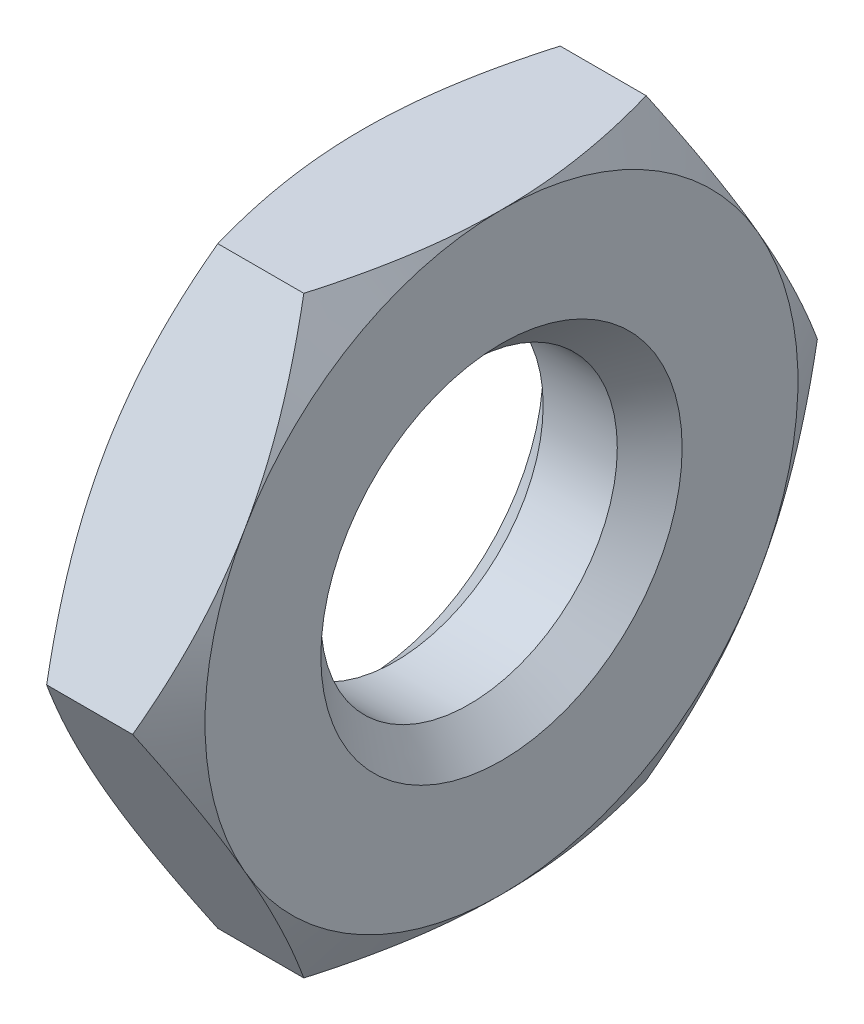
ISO-10303-21;
HEADER;
FILE_DESCRIPTION(('STEP AP214'),'2;1');
FILE_NAME('part.step','',(''),(''),'','','');
FILE_SCHEMA(('AUTOMOTIVE_DESIGN { 1 0 10303 214 1 1 1 1 }'));
ENDSEC;
DATA;
#1=APPLICATION_CONTEXT('core data for automotive mechanical design processes');
#2=APPLICATION_PROTOCOL_DEFINITION('international standard','automotive_design',2000,#1);
#3=PRODUCT_CONTEXT('',#1,'mechanical');
#4=PRODUCT('Part','Part','',(#3));
#5=PRODUCT_RELATED_PRODUCT_CATEGORY('part','',(#4));
#6=PRODUCT_DEFINITION_FORMATION('','',#4);
#7=PRODUCT_DEFINITION_CONTEXT('part definition',#1,'design');
#8=PRODUCT_DEFINITION('design','',#6,#7);
#9=PRODUCT_DEFINITION_SHAPE('','',#8);
#10=(LENGTH_UNIT() NAMED_UNIT(*) SI_UNIT(.MILLI.,.METRE.));
#11=(NAMED_UNIT(*) PLANE_ANGLE_UNIT() SI_UNIT($,.RADIAN.));
#12=(NAMED_UNIT(*) SI_UNIT($,.STERADIAN.) SOLID_ANGLE_UNIT());
#13=UNCERTAINTY_MEASURE_WITH_UNIT(LENGTH_MEASURE(1.E-05),#10,'distance_accuracy_value','');
#14=(GEOMETRIC_REPRESENTATION_CONTEXT(3) GLOBAL_UNCERTAINTY_ASSIGNED_CONTEXT((#13)) GLOBAL_UNIT_ASSIGNED_CONTEXT((#10,
#11,#12)) REPRESENTATION_CONTEXT('',''));
#15=CARTESIAN_POINT('',(0.,0.,0.));
#16=DIRECTION('',(0.,0.,1.));
#17=DIRECTION('',(1.,0.,0.));
#18=AXIS2_PLACEMENT_3D('',#15,#16,#17);
#19=CARTESIAN_POINT('',(0.75,1.6,-0.923760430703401));
#20=DIRECTION('',(1.,0.,0.));
#21=DIRECTION('',(0.,0.,-1.));
#22=AXIS2_PLACEMENT_3D('',#19,#20,#21);
#23=PLANE('',#22);
#24=CARTESIAN_POINT('',(0.75,0.,0.));
#25=DIRECTION('',(1.,0.,0.));
#26=DIRECTION('',(0.,0.,-1.));
#27=AXIS2_PLACEMENT_3D('',#24,#25,#26);
#28=CIRCLE('',#27,0.975000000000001);
#29=CARTESIAN_POINT('',(0.75,0.,-0.975000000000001));
#30=VERTEX_POINT('',#29);
#31=EDGE_CURVE('E11',#30,#30,#28,.F.);
#32=ORIENTED_EDGE('',*,*,#31,.T.);
#33=EDGE_LOOP('',(#32));
#34=FACE_BOUND('',#33,.T.);
#35=CARTESIAN_POINT('',(0.75,0.,0.));
#36=DIRECTION('',(1.,0.,0.));
#37=DIRECTION('',(0.,0.,-1.));
#38=AXIS2_PLACEMENT_3D('',#35,#36,#37);
#39=CIRCLE('',#38,1.6);
#40=CARTESIAN_POINT('',(0.75,-1.6,0.));
#41=VERTEX_POINT('',#40);
#42=CARTESIAN_POINT('',(0.75,-0.8,-1.3856406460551));
#43=VERTEX_POINT('',#42);
#44=EDGE_CURVE('E142',#41,#43,#39,.T.);
#45=ORIENTED_EDGE('',*,*,#44,.T.);
#46=CARTESIAN_POINT('',(0.75,0.8,-1.3856406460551));
#47=VERTEX_POINT('',#46);
#48=EDGE_CURVE('E130',#43,#47,#39,.T.);
#49=ORIENTED_EDGE('',*,*,#48,.T.);
#50=CARTESIAN_POINT('',(0.75,1.6,0.));
#51=VERTEX_POINT('',#50);
#52=EDGE_CURVE('E144',#47,#51,#39,.T.);
#53=ORIENTED_EDGE('',*,*,#52,.T.);
#54=CARTESIAN_POINT('',(0.75,0.8,1.3856406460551));
#55=VERTEX_POINT('',#54);
#56=EDGE_CURVE('E55',#51,#55,#39,.T.);
#57=ORIENTED_EDGE('',*,*,#56,.T.);
#58=CARTESIAN_POINT('',(0.75,-0.8,1.3856406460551));
#59=VERTEX_POINT('',#58);
#60=EDGE_CURVE('E63',#55,#59,#39,.T.);
#61=ORIENTED_EDGE('',*,*,#60,.T.);
#62=EDGE_CURVE('E166',#59,#41,#39,.T.);
#63=ORIENTED_EDGE('',*,*,#62,.T.);
#64=EDGE_LOOP('',(#45,#49,#53,#57,#61,#63));
#65=FACE_BOUND('',#64,.T.);
#66=ADVANCED_FACE('F39',(#34,#65),#23,.T.);
#67=CARTESIAN_POINT('',(0.,1.6,-0.923760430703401));
#68=DIRECTION('',(1.,0.,0.));
#69=DIRECTION('',(0.,0.,-1.));
#70=AXIS2_PLACEMENT_3D('',#67,#68,#69);
#71=PLANE('',#70);
#72=CARTESIAN_POINT('',(0.,0.,0.));
#73=DIRECTION('',(1.,0.,0.));
#74=DIRECTION('',(0.,0.,-1.));
#75=AXIS2_PLACEMENT_3D('',#72,#73,#74);
#76=CIRCLE('',#75,0.975);
#77=CARTESIAN_POINT('',(0.,0.,-0.975));
#78=VERTEX_POINT('',#77);
#79=EDGE_CURVE('E164',#78,#78,#76,.T.);
#80=ORIENTED_EDGE('',*,*,#79,.T.);
#81=EDGE_LOOP('',(#80));
#82=FACE_BOUND('',#81,.T.);
#83=CARTESIAN_POINT('',(0.,0.,0.));
#84=DIRECTION('',(1.,0.,0.));
#85=DIRECTION('',(0.,0.,-1.));
#86=AXIS2_PLACEMENT_3D('',#83,#84,#85);
#87=CIRCLE('',#86,1.6);
#88=CARTESIAN_POINT('',(0.,-0.8,-1.3856406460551));
#89=VERTEX_POINT('',#88);
#90=CARTESIAN_POINT('',(0.,0.8,-1.3856406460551));
#91=VERTEX_POINT('',#90);
#92=EDGE_CURVE('E173',#89,#91,#87,.T.);
#93=ORIENTED_EDGE('',*,*,#92,.F.);
#94=CARTESIAN_POINT('',(0.,-1.6,0.));
#95=VERTEX_POINT('',#94);
#96=EDGE_CURVE('E316',#95,#89,#87,.T.);
#97=ORIENTED_EDGE('',*,*,#96,.F.);
#98=CARTESIAN_POINT('',(0.,-0.8,1.3856406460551));
#99=VERTEX_POINT('',#98);
#100=EDGE_CURVE('E319',#99,#95,#87,.T.);
#101=ORIENTED_EDGE('',*,*,#100,.F.);
#102=CARTESIAN_POINT('',(0.,0.8,1.3856406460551));
#103=VERTEX_POINT('',#102);
#104=EDGE_CURVE('E325',#103,#99,#87,.T.);
#105=ORIENTED_EDGE('',*,*,#104,.F.);
#106=CARTESIAN_POINT('',(0.,1.6,0.));
#107=VERTEX_POINT('',#106);
#108=EDGE_CURVE('E178',#107,#103,#87,.T.);
#109=ORIENTED_EDGE('',*,*,#108,.F.);
#110=EDGE_CURVE('E174',#91,#107,#87,.T.);
#111=ORIENTED_EDGE('',*,*,#110,.F.);
#112=EDGE_LOOP('',(#93,#97,#101,#105,#109,#111));
#113=FACE_BOUND('',#112,.T.);
#114=ADVANCED_FACE('F317',(#82,#113),#71,.F.);
#115=CARTESIAN_POINT('',(0.75,0.,0.));
#116=DIRECTION('',(-1.,0.,0.));
#117=DIRECTION('',(0.,0.,1.));
#118=AXIS2_PLACEMENT_3D('',#115,#116,#117);
#119=CYLINDRICAL_SURFACE('',#118,0.8);
#120=CARTESIAN_POINT('',(0.175,0.,0.));
#121=DIRECTION('',(1.,0.,0.));
#122=DIRECTION('',(0.,0.,-1.));
#123=AXIS2_PLACEMENT_3D('',#120,#121,#122);
#124=CIRCLE('',#123,0.8);
#125=CARTESIAN_POINT('',(0.175,0.,-0.8));
#126=VERTEX_POINT('',#125);
#127=EDGE_CURVE('E48',#126,#126,#124,.F.);
#128=ORIENTED_EDGE('',*,*,#127,.T.);
#129=EDGE_LOOP('',(#128));
#130=FACE_BOUND('',#129,.T.);
#131=CARTESIAN_POINT('',(0.575,0.,0.));
#132=DIRECTION('',(1.,0.,0.));
#133=DIRECTION('',(0.,0.,-1.));
#134=AXIS2_PLACEMENT_3D('',#131,#132,#133);
#135=CIRCLE('',#134,0.8);
#136=CARTESIAN_POINT('',(0.575,0.,-0.8));
#137=VERTEX_POINT('',#136);
#138=EDGE_CURVE('E408',#137,#137,#135,.T.);
#139=ORIENTED_EDGE('',*,*,#138,.T.);
#140=EDGE_LOOP('',(#139));
#141=FACE_BOUND('',#140,.T.);
#142=ADVANCED_FACE('F234',(#130,#141),#119,.F.);
#143=CARTESIAN_POINT('',(0.,0.,0.));
#144=DIRECTION('',(1.,0.,0.));
#145=DIRECTION('',(0.,0.,-1.));
#146=AXIS2_PLACEMENT_3D('',#143,#144,#145);
#147=CONICAL_SURFACE('',#146,1.6,1.0471975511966);
#148=CARTESIAN_POINT('',(0.142972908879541,-1.6002,-0.923644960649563));
#149=CARTESIAN_POINT('',(0.119523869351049,-1.52988631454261,-0.964240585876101));
#150=CARTESIAN_POINT('',(0.0981973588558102,-1.45896568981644,-1.00518662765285));
#151=CARTESIAN_POINT('',(0.0609706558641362,-1.31589622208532,-1.08778782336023));
#152=CARTESIAN_POINT('',(0.0450836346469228,-1.24374483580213,-1.12944444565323));
#153=CARTESIAN_POINT('',(0.0203517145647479,-1.10033630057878,-1.21224140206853));
#154=CARTESIAN_POINT('',(0.0113422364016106,-1.02910122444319,-1.25336899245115));
#155=CARTESIAN_POINT('',(0.000584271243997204,-0.886295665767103,-1.33581782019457));
#156=CARTESIAN_POINT('',(-0.00117312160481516,-0.814725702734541,-1.37713875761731));
#157=CARTESIAN_POINT('',(0.0024711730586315,-0.680978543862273,-1.45435771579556));
#158=CARTESIAN_POINT('',(0.00697805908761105,-0.618781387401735,-1.49026726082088));
#159=CARTESIAN_POINT('',(0.0212658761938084,-0.494792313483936,-1.56185238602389));
#160=CARTESIAN_POINT('',(0.0310516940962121,-0.433000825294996,-1.59752771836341));
#161=CARTESIAN_POINT('',(0.0555169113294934,-0.308755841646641,-1.66926059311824));
#162=CARTESIAN_POINT('',(0.0703000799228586,-0.246318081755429,-1.70530905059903));
#163=CARTESIAN_POINT('',(0.103852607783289,-0.122374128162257,-1.77686812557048));
#164=CARTESIAN_POINT('',(0.122614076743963,-0.0608663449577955,-1.81237966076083));
#165=CARTESIAN_POINT('',(0.142972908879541,0.00020000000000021,-1.84763633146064));
#166=B_SPLINE_CURVE_WITH_KNOTS('',3,(#148,#149,#150,#151,#152,#153,#154,#155,#156,#157,#158,
#159,#160,#161,#162,#163,#164,#165),.UNSPECIFIED.,.F.,.F.,(4,2,2,2,2,2,2,2,4),(0.,
0.25362862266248,0.507867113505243,0.755812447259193,1.00345320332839,1.21912891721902,
1.43500463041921,1.65567058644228,1.87590291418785),.UNSPECIFIED.);
#167=CARTESIAN_POINT('',(0.142906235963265,0.,-1.8475208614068));
#168=VERTEX_POINT('',#167);
#169=EDGE_CURVE('E332',#89,#168,#166,.T.);
#170=ORIENTED_EDGE('',*,*,#169,.F.);
#171=ORIENTED_EDGE('',*,*,#92,.T.);
#172=CARTESIAN_POINT('',(0.142972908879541,-0.000199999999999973,-1.84763633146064));
#173=CARTESIAN_POINT('',(0.119523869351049,0.070113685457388,-1.8070407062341));
#174=CARTESIAN_POINT('',(0.0981973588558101,0.141034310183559,-1.76609466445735));
#175=CARTESIAN_POINT('',(0.0609706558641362,0.284103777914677,-1.68349346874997));
#176=CARTESIAN_POINT('',(0.0450836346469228,0.356255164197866,-1.64183684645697));
#177=CARTESIAN_POINT('',(0.0203517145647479,0.499663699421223,-1.55903989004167));
#178=CARTESIAN_POINT('',(0.0113422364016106,0.570898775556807,-1.51791229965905));
#179=CARTESIAN_POINT('',(0.000584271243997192,0.713704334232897,-1.43546347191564));
#180=CARTESIAN_POINT('',(-0.00117312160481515,0.785274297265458,-1.3941425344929));
#181=CARTESIAN_POINT('',(0.00247117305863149,0.919021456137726,-1.31692357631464));
#182=CARTESIAN_POINT('',(0.006978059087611,0.981218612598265,-1.28101403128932));
#183=CARTESIAN_POINT('',(0.0212658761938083,1.10520768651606,-1.20942890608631));
#184=CARTESIAN_POINT('',(0.031051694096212,1.166999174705,-1.1737535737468));
#185=CARTESIAN_POINT('',(0.0555169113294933,1.29124415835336,-1.10202069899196));
#186=CARTESIAN_POINT('',(0.0703000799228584,1.35368191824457,-1.06597224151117));
#187=CARTESIAN_POINT('',(0.103852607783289,1.47762587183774,-0.994413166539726));
#188=CARTESIAN_POINT('',(0.122614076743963,1.5391336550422,-0.958901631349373));
#189=CARTESIAN_POINT('',(0.142972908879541,1.6002,-0.923644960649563));
#190=B_SPLINE_CURVE_WITH_KNOTS('',3,(#172,#173,#174,#175,#176,#177,#178,#179,#180,#181,#182,
#183,#184,#185,#186,#187,#188,#189),.UNSPECIFIED.,.F.,.F.,(4,2,2,2,2,2,2,2,4),(0.,
0.25362862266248,0.507867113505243,0.755812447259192,1.00345320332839,1.21912891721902,
1.43500463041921,1.65567058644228,1.87590291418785),.UNSPECIFIED.);
#191=EDGE_CURVE('E215',#168,#91,#190,.T.);
#192=ORIENTED_EDGE('',*,*,#191,.F.);
#193=EDGE_LOOP('',(#170,#171,#192));
#194=FACE_BOUND('',#193,.T.);
#195=ADVANCED_FACE('F194',(#194),#147,.T.);
#196=ORIENTED_EDGE('',*,*,#96,.T.);
#197=CARTESIAN_POINT('',(0.142906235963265,-1.6,-0.923760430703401));
#198=VERTEX_POINT('',#197);
#199=EDGE_CURVE('E156',#198,#89,#166,.T.);
#200=ORIENTED_EDGE('',*,*,#199,.F.);
#201=CARTESIAN_POINT('',(0.781305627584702,-1.6,-2.48228741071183));
#202=CARTESIAN_POINT('',(0.747399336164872,-1.6,-2.41239835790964));
#203=CARTESIAN_POINT('',(0.713817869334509,-1.6,-2.342348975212));
#204=CARTESIAN_POINT('',(0.647487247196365,-1.6,-2.20184429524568));
#205=CARTESIAN_POINT('',(0.614738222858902,-1.6,-2.13138893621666));
#206=CARTESIAN_POINT('',(0.550090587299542,-1.6,-1.98962448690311));
#207=CARTESIAN_POINT('',(0.518197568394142,-1.6,-1.91831283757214));
#208=CARTESIAN_POINT('',(0.455715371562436,-1.6,-1.77512270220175));
#209=CARTESIAN_POINT('',(0.425126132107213,-1.6,-1.70324424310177));
#210=CARTESIAN_POINT('',(0.364636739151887,-1.6,-1.55647955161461));
#211=CARTESIAN_POINT('',(0.334790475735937,-1.6,-1.48157098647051));
#212=CARTESIAN_POINT('',(0.277354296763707,-1.6,-1.33087725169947));
#213=CARTESIAN_POINT('',(0.249764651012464,-1.6,-1.25509197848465));
#214=CARTESIAN_POINT('',(0.19756670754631,-1.6,-1.10266970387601));
#215=CARTESIAN_POINT('',(0.172952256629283,-1.6,-1.02603483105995));
#216=CARTESIAN_POINT('',(0.127490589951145,-1.6,-0.871659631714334));
#217=CARTESIAN_POINT('',(0.106642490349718,-1.6,-0.79391956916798));
#218=CARTESIAN_POINT('',(0.0698283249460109,-1.6,-0.637732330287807));
#219=CARTESIAN_POINT('',(0.0538354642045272,-1.6,-0.559291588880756));
#220=CARTESIAN_POINT('',(0.0276325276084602,-1.6,-0.401434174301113));
#221=CARTESIAN_POINT('',(0.0174219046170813,-1.6,-0.32201759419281));
#222=CARTESIAN_POINT('',(0.0037342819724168,-1.6,-0.163639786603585));
#223=CARTESIAN_POINT('',(0.000170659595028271,-1.6,-0.0846862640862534));
#224=CARTESIAN_POINT('',(-0.000158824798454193,-1.6,0.0732324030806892));
#225=CARTESIAN_POINT('',(0.003075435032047,-1.6,0.152197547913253));
#226=CARTESIAN_POINT('',(0.0187030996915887,-1.6,0.341588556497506));
#227=CARTESIAN_POINT('',(0.034285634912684,-1.6,0.451752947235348));
#228=CARTESIAN_POINT('',(0.0759566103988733,-1.6,0.670080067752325));
#229=CARTESIAN_POINT('',(0.10205531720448,-1.6,0.778240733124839));
#230=CARTESIAN_POINT('',(0.162565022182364,-1.6,0.994730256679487));
#231=CARTESIAN_POINT('',(0.197146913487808,-1.6,1.10301004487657));
#232=CARTESIAN_POINT('',(0.271877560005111,-1.6,1.31755742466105));
#233=CARTESIAN_POINT('',(0.312024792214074,-1.6,1.423825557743));
#234=CARTESIAN_POINT('',(0.410850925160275,-1.6,1.67158156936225));
#235=CARTESIAN_POINT('',(0.471110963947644,-1.6,1.81243218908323));
#236=CARTESIAN_POINT('',(0.596041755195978,-1.6,2.0921761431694));
#237=CARTESIAN_POINT('',(0.660713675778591,-1.6,2.23106894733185));
#238=CARTESIAN_POINT('',(0.793025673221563,-1.6,2.50759720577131));
#239=CARTESIAN_POINT('',(0.86066865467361,-1.6,2.6452312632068));
#240=CARTESIAN_POINT('',(0.99794431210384,-1.6,2.91950447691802));
#241=CARTESIAN_POINT('',(1.06757705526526,-1.6,3.05614359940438));
#242=CARTESIAN_POINT('',(1.20243231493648,-1.6,3.31741058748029));
#243=CARTESIAN_POINT('',(1.26754276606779,-1.6,3.44209644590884));
#244=CARTESIAN_POINT('',(1.39865923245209,-1.6,3.69100120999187));
#245=CARTESIAN_POINT('',(1.46466527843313,-1.6,3.81522009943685));
#246=CARTESIAN_POINT('',(1.59719814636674,-1.6,4.06298795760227));
#247=CARTESIAN_POINT('',(1.66372329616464,-1.6,4.18653782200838));
#248=CARTESIAN_POINT('',(1.79731069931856,-1.6,4.43333827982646));
#249=CARTESIAN_POINT('',(1.86437292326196,-1.6,4.55658888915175));
#250=CARTESIAN_POINT('',(1.93163587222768,-1.6,4.6797290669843));
#251=B_SPLINE_CURVE_WITH_KNOTS('',3,(#201,#202,#203,#204,#205,#206,#207,#208,#209,#210,#211,
#212,#213,#214,#215,#216,#217,#218,#219,#220,#221,#222,#223,#224,#225,#226,#227,#228,#229,#230,
#231,#232,#233,#234,#235,#236,#237,#238,#239,#240,#241,#242,#243,#244,#245,#246,#247,#248,#249,
#250),.UNSPECIFIED.,.F.,.F.,(4,2,2,2,2,2,2,2,2,2,2,2,2,2,2,2,2,2,2,2,2,2,2,2,4),(0.,
0.233041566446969,0.466119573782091,0.700464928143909,0.934799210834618,1.17667776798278,
1.41858520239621,1.65998344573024,1.90132496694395,2.14130929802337,2.38127091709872,
2.61808293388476,2.85489919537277,3.18799484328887,3.52141647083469,3.86220384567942,
4.20289814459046,4.66236680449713,5.12195759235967,5.5820081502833,6.04207425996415,
6.4640571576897,6.88605457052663,7.30701806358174,7.72795865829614),.UNSPECIFIED.);
#252=EDGE_CURVE('E177',#95,#198,#251,.F.);
#253=ORIENTED_EDGE('',*,*,#252,.F.);
#254=EDGE_LOOP('',(#196,#200,#253));
#255=FACE_BOUND('',#254,.T.);
#256=ADVANCED_FACE('F349',(#255),#147,.T.);
#257=CARTESIAN_POINT('',(0.375,0.,0.));
#258=DIRECTION('',(-1.,0.,0.));
#259=DIRECTION('',(0.,0.,1.));
#260=AXIS2_PLACEMENT_3D('',#257,#258,#259);
#261=CONICAL_SURFACE('',#260,2.24951905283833,1.0471975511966);
#262=CARTESIAN_POINT('',(0.607027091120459,0.000200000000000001,-1.84763633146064));
#263=CARTESIAN_POINT('',(0.630476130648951,-0.0701136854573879,-1.8070407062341));
#264=CARTESIAN_POINT('',(0.65180264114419,-0.141034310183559,-1.76609466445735));
#265=CARTESIAN_POINT('',(0.689029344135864,-0.284103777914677,-1.68349346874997));
#266=CARTESIAN_POINT('',(0.704916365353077,-0.356255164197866,-1.64183684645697));
#267=CARTESIAN_POINT('',(0.729648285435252,-0.499663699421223,-1.55903989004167));
#268=CARTESIAN_POINT('',(0.738657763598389,-0.570898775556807,-1.51791229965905));
#269=CARTESIAN_POINT('',(0.749415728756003,-0.713704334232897,-1.43546347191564));
#270=CARTESIAN_POINT('',(0.751173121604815,-0.785274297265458,-1.3941425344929));
#271=CARTESIAN_POINT('',(0.747528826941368,-0.919021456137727,-1.31692357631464));
#272=CARTESIAN_POINT('',(0.743021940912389,-0.981218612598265,-1.28101403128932));
#273=CARTESIAN_POINT('',(0.728734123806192,-1.10520768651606,-1.20942890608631));
#274=CARTESIAN_POINT('',(0.718948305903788,-1.166999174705,-1.1737535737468));
#275=CARTESIAN_POINT('',(0.694483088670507,-1.29124415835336,-1.10202069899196));
#276=CARTESIAN_POINT('',(0.679699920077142,-1.35368191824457,-1.06597224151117));
#277=CARTESIAN_POINT('',(0.646147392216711,-1.47762587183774,-0.994413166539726));
#278=CARTESIAN_POINT('',(0.627385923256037,-1.5391336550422,-0.958901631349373));
#279=CARTESIAN_POINT('',(0.607027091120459,-1.6002,-0.923644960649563));
#280=B_SPLINE_CURVE_WITH_KNOTS('',3,(#262,#263,#264,#265,#266,#267,#268,#269,#270,#271,#272,
#273,#274,#275,#276,#277,#278,#279),.UNSPECIFIED.,.F.,.F.,(4,2,2,2,2,2,2,2,4),(0.,
0.25362862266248,0.507867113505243,0.755812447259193,1.00345320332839,1.21912891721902,
1.43500463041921,1.65567058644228,1.87590291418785),.UNSPECIFIED.);
#281=CARTESIAN_POINT('',(0.607093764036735,-1.6,-0.923760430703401));
#282=VERTEX_POINT('',#281);
#283=EDGE_CURVE('E147',#43,#282,#280,.T.);
#284=ORIENTED_EDGE('',*,*,#283,.F.);
#285=ORIENTED_EDGE('',*,*,#44,.F.);
#286=CARTESIAN_POINT('',(-0.0313056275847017,-1.6,-2.48228741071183));
#287=CARTESIAN_POINT('',(0.00260066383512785,-1.6,-2.41239835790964));
#288=CARTESIAN_POINT('',(0.0361821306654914,-1.6,-2.342348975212));
#289=CARTESIAN_POINT('',(0.102512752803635,-1.6,-2.20184429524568));
#290=CARTESIAN_POINT('',(0.135261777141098,-1.6,-2.13138893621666));
#291=CARTESIAN_POINT('',(0.199909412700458,-1.6,-1.98962448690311));
#292=CARTESIAN_POINT('',(0.231802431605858,-1.6,-1.91831283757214));
#293=CARTESIAN_POINT('',(0.294284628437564,-1.6,-1.77512270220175));
#294=CARTESIAN_POINT('',(0.324873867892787,-1.6,-1.70324424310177));
#295=CARTESIAN_POINT('',(0.385363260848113,-1.6,-1.55647955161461));
#296=CARTESIAN_POINT('',(0.415209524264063,-1.6,-1.48157098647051));
#297=CARTESIAN_POINT('',(0.472645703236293,-1.6,-1.33087725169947));
#298=CARTESIAN_POINT('',(0.500235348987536,-1.6,-1.25509197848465));
#299=CARTESIAN_POINT('',(0.55243329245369,-1.6,-1.10266970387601));
#300=CARTESIAN_POINT('',(0.577047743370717,-1.6,-1.02603483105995));
#301=CARTESIAN_POINT('',(0.622509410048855,-1.6,-0.871659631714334));
#302=CARTESIAN_POINT('',(0.643357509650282,-1.6,-0.793919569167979));
#303=CARTESIAN_POINT('',(0.680171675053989,-1.6,-0.637732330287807));
#304=CARTESIAN_POINT('',(0.696164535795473,-1.6,-0.559291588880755));
#305=CARTESIAN_POINT('',(0.72236747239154,-1.6,-0.401434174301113));
#306=CARTESIAN_POINT('',(0.732578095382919,-1.6,-0.32201759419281));
#307=CARTESIAN_POINT('',(0.746265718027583,-1.6,-0.163639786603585));
#308=CARTESIAN_POINT('',(0.749829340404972,-1.6,-0.0846862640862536));
#309=CARTESIAN_POINT('',(0.750158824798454,-1.6,0.0732324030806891));
#310=CARTESIAN_POINT('',(0.746924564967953,-1.6,0.152197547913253));
#311=CARTESIAN_POINT('',(0.731296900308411,-1.6,0.341588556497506));
#312=CARTESIAN_POINT('',(0.715714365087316,-1.6,0.451752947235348));
#313=CARTESIAN_POINT('',(0.674043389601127,-1.6,0.670080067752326));
#314=CARTESIAN_POINT('',(0.64794468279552,-1.6,0.778240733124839));
#315=CARTESIAN_POINT('',(0.587434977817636,-1.6,0.994730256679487));
#316=CARTESIAN_POINT('',(0.552853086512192,-1.6,1.10301004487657));
#317=CARTESIAN_POINT('',(0.478122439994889,-1.6,1.31755742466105));
#318=CARTESIAN_POINT('',(0.437975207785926,-1.6,1.423825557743));
#319=CARTESIAN_POINT('',(0.339149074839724,-1.6,1.67158156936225));
#320=CARTESIAN_POINT('',(0.278889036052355,-1.6,1.81243218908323));
#321=CARTESIAN_POINT('',(0.153958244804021,-1.6,2.0921761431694));
#322=CARTESIAN_POINT('',(0.0892863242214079,-1.6,2.23106894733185));
#323=CARTESIAN_POINT('',(-0.0430256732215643,-1.6,2.50759720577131));
#324=CARTESIAN_POINT('',(-0.110668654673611,-1.6,2.6452312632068));
#325=CARTESIAN_POINT('',(-0.247944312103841,-1.6,2.91950447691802));
#326=CARTESIAN_POINT('',(-0.31757705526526,-1.6,3.05614359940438));
#327=CARTESIAN_POINT('',(-0.452432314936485,-1.6,3.31741058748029));
#328=CARTESIAN_POINT('',(-0.517542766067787,-1.6,3.44209644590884));
#329=CARTESIAN_POINT('',(-0.648659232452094,-1.6,3.69100120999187));
#330=CARTESIAN_POINT('',(-0.714665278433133,-1.6,3.81522009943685));
#331=CARTESIAN_POINT('',(-0.847198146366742,-1.6,4.06298795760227));
#332=CARTESIAN_POINT('',(-0.913723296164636,-1.6,4.18653782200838));
#333=CARTESIAN_POINT('',(-1.04731069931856,-1.6,4.43333827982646));
#334=CARTESIAN_POINT('',(-1.11437292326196,-1.6,4.55658888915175));
#335=CARTESIAN_POINT('',(-1.18163587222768,-1.6,4.6797290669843));
#336=B_SPLINE_CURVE_WITH_KNOTS('',3,(#286,#287,#288,#289,#290,#291,#292,#293,#294,#295,#296,
#297,#298,#299,#300,#301,#302,#303,#304,#305,#306,#307,#308,#309,#310,#311,#312,#313,#314,#315,
#316,#317,#318,#319,#320,#321,#322,#323,#324,#325,#326,#327,#328,#329,#330,#331,#332,#333,#334,
#335),.UNSPECIFIED.,.F.,.F.,(4,2,2,2,2,2,2,2,2,2,2,2,2,2,2,2,2,2,2,2,2,2,2,2,4),(0.,
0.233041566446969,0.466119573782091,0.700464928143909,0.934799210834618,1.17667776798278,
1.41858520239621,1.65998344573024,1.90132496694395,2.14130929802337,2.38127091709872,
2.61808293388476,2.85489919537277,3.18799484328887,3.52141647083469,3.86220384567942,
4.20289814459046,4.66236680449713,5.12195759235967,5.58200815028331,6.04207425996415,
6.4640571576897,6.88605457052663,7.30701806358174,7.72795865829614),.UNSPECIFIED.);
#337=EDGE_CURVE('E151',#282,#41,#336,.T.);
#338=ORIENTED_EDGE('',*,*,#337,.F.);
#339=EDGE_LOOP('',(#284,#285,#338));
#340=FACE_BOUND('',#339,.T.);
#341=ADVANCED_FACE('F148',(#340),#261,.T.);
#342=ORIENTED_EDGE('',*,*,#48,.F.);
#343=CARTESIAN_POINT('',(0.607093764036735,0.,-1.8475208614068));
#344=VERTEX_POINT('',#343);
#345=EDGE_CURVE('E134',#344,#43,#280,.T.);
#346=ORIENTED_EDGE('',*,*,#345,.F.);
#347=CARTESIAN_POINT('',(0.607027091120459,1.6002,-0.923644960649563));
#348=CARTESIAN_POINT('',(0.630476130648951,1.52988631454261,-0.964240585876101));
#349=CARTESIAN_POINT('',(0.65180264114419,1.45896568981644,-1.00518662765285));
#350=CARTESIAN_POINT('',(0.689029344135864,1.31589622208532,-1.08778782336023));
#351=CARTESIAN_POINT('',(0.704916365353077,1.24374483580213,-1.12944444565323));
#352=CARTESIAN_POINT('',(0.729648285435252,1.10033630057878,-1.21224140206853));
#353=CARTESIAN_POINT('',(0.73865776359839,1.02910122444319,-1.25336899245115));
#354=CARTESIAN_POINT('',(0.749415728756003,0.886295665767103,-1.33581782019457));
#355=CARTESIAN_POINT('',(0.751173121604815,0.814725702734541,-1.37713875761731));
#356=CARTESIAN_POINT('',(0.747528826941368,0.680978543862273,-1.45435771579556));
#357=CARTESIAN_POINT('',(0.743021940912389,0.618781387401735,-1.49026726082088));
#358=CARTESIAN_POINT('',(0.728734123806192,0.494792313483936,-1.56185238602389));
#359=CARTESIAN_POINT('',(0.718948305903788,0.433000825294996,-1.59752771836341));
#360=CARTESIAN_POINT('',(0.694483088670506,0.308755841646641,-1.66926059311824));
#361=CARTESIAN_POINT('',(0.679699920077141,0.246318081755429,-1.70530905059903));
#362=CARTESIAN_POINT('',(0.646147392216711,0.122374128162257,-1.77686812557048));
#363=CARTESIAN_POINT('',(0.627385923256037,0.0608663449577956,-1.81237966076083));
#364=CARTESIAN_POINT('',(0.607027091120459,-0.000199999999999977,-1.84763633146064));
#365=B_SPLINE_CURVE_WITH_KNOTS('',3,(#347,#348,#349,#350,#351,#352,#353,#354,#355,#356,#357,
#358,#359,#360,#361,#362,#363,#364),.UNSPECIFIED.,.F.,.F.,(4,2,2,2,2,2,2,2,4),(0.,
0.25362862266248,0.507867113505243,0.755812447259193,1.00345320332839,1.21912891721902,
1.43500463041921,1.65567058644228,1.87590291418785),.UNSPECIFIED.);
#366=EDGE_CURVE('E136',#47,#344,#365,.T.);
#367=ORIENTED_EDGE('',*,*,#366,.F.);
#368=EDGE_LOOP('',(#342,#346,#367));
#369=FACE_BOUND('',#368,.T.);
#370=ADVANCED_FACE('F132',(#369),#261,.T.);
#371=ORIENTED_EDGE('',*,*,#100,.T.);
#372=CARTESIAN_POINT('',(0.142906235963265,-1.6,0.9237604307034));
#373=VERTEX_POINT('',#372);
#374=EDGE_CURVE('E187',#373,#95,#251,.F.);
#375=ORIENTED_EDGE('',*,*,#374,.F.);
#376=CARTESIAN_POINT('',(0.142972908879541,0.000199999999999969,1.84763633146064));
#377=CARTESIAN_POINT('',(0.119523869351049,-0.070113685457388,1.8070407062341));
#378=CARTESIAN_POINT('',(0.0981973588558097,-0.141034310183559,1.76609466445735));
#379=CARTESIAN_POINT('',(0.0609706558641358,-0.284103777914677,1.68349346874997));
#380=CARTESIAN_POINT('',(0.0450836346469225,-0.356255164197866,1.64183684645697));
#381=CARTESIAN_POINT('',(0.0203517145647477,-0.499663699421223,1.55903989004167));
#382=CARTESIAN_POINT('',(0.0113422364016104,-0.570898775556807,1.51791229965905));
#383=CARTESIAN_POINT('',(0.000584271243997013,-0.713704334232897,1.43546347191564));
#384=CARTESIAN_POINT('',(-0.00117312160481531,-0.785274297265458,1.3941425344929));
#385=CARTESIAN_POINT('',(0.00247117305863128,-0.919021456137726,1.31692357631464));
#386=CARTESIAN_POINT('',(0.00697805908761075,-0.981218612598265,1.28101403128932));
#387=CARTESIAN_POINT('',(0.021265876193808,-1.10520768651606,1.20942890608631));
#388=CARTESIAN_POINT('',(0.0310516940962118,-1.166999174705,1.1737535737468));
#389=CARTESIAN_POINT('',(0.055516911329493,-1.29124415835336,1.10202069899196));
#390=CARTESIAN_POINT('',(0.0703000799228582,-1.35368191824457,1.06597224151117));
#391=CARTESIAN_POINT('',(0.103852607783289,-1.47762587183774,0.994413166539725));
#392=CARTESIAN_POINT('',(0.122614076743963,-1.5391336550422,0.958901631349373));
#393=CARTESIAN_POINT('',(0.142972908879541,-1.6002,0.923644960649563));
#394=B_SPLINE_CURVE_WITH_KNOTS('',3,(#376,#377,#378,#379,#380,#381,#382,#383,#384,#385,#386,
#387,#388,#389,#390,#391,#392,#393),.UNSPECIFIED.,.F.,.F.,(4,2,2,2,2,2,2,2,4),(0.,
0.25362862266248,0.507867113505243,0.755812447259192,1.00345320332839,1.21912891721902,
1.43500463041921,1.65567058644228,1.87590291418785),.UNSPECIFIED.);
#395=EDGE_CURVE('E188',#99,#373,#394,.T.);
#396=ORIENTED_EDGE('',*,*,#395,.F.);
#397=EDGE_LOOP('',(#371,#375,#396));
#398=FACE_BOUND('',#397,.T.);
#399=ADVANCED_FACE('F348',(#398),#147,.T.);
#400=CARTESIAN_POINT('',(0.607093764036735,-1.6,0.9237604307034));
#401=VERTEX_POINT('',#400);
#402=EDGE_CURVE('E216',#41,#401,#336,.T.);
#403=ORIENTED_EDGE('',*,*,#402,.F.);
#404=ORIENTED_EDGE('',*,*,#62,.F.);
#405=CARTESIAN_POINT('',(0.607027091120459,-1.6002,0.923644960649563));
#406=CARTESIAN_POINT('',(0.630476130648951,-1.52988631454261,0.9642405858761));
#407=CARTESIAN_POINT('',(0.65180264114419,-1.45896568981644,1.00518662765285));
#408=CARTESIAN_POINT('',(0.689029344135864,-1.31589622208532,1.08778782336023));
#409=CARTESIAN_POINT('',(0.704916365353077,-1.24374483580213,1.12944444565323));
#410=CARTESIAN_POINT('',(0.729648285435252,-1.10033630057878,1.21224140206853));
#411=CARTESIAN_POINT('',(0.73865776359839,-1.02910122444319,1.25336899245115));
#412=CARTESIAN_POINT('',(0.749415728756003,-0.886295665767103,1.33581782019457));
#413=CARTESIAN_POINT('',(0.751173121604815,-0.814725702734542,1.37713875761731));
#414=CARTESIAN_POINT('',(0.747528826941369,-0.680978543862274,1.45435771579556));
#415=CARTESIAN_POINT('',(0.743021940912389,-0.618781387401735,1.49026726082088));
#416=CARTESIAN_POINT('',(0.728734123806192,-0.494792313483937,1.56185238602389));
#417=CARTESIAN_POINT('',(0.718948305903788,-0.433000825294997,1.59752771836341));
#418=CARTESIAN_POINT('',(0.694483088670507,-0.308755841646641,1.66926059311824));
#419=CARTESIAN_POINT('',(0.679699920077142,-0.24631808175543,1.70530905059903));
#420=CARTESIAN_POINT('',(0.646147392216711,-0.122374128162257,1.77686812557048));
#421=CARTESIAN_POINT('',(0.627385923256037,-0.060866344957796,1.81237966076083));
#422=CARTESIAN_POINT('',(0.607027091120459,0.000199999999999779,1.84763633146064));
#423=B_SPLINE_CURVE_WITH_KNOTS('',3,(#405,#406,#407,#408,#409,#410,#411,#412,#413,#414,#415,
#416,#417,#418,#419,#420,#421,#422),.UNSPECIFIED.,.F.,.F.,(4,2,2,2,2,2,2,2,4),(0.,
0.25362862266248,0.507867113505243,0.755812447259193,1.00345320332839,1.21912891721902,
1.43500463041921,1.65567058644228,1.87590291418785),.UNSPECIFIED.);
#424=EDGE_CURVE('E247',#401,#59,#423,.T.);
#425=ORIENTED_EDGE('',*,*,#424,.F.);
#426=EDGE_LOOP('',(#403,#404,#425));
#427=FACE_BOUND('',#426,.T.);
#428=ADVANCED_FACE('F393',(#427),#261,.T.);
#429=ORIENTED_EDGE('',*,*,#104,.T.);
#430=CARTESIAN_POINT('',(0.142906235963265,0.,1.8475208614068));
#431=VERTEX_POINT('',#430);
#432=EDGE_CURVE('E288',#431,#99,#394,.T.);
#433=ORIENTED_EDGE('',*,*,#432,.F.);
#434=CARTESIAN_POINT('',(0.142972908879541,1.6002,0.923644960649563));
#435=CARTESIAN_POINT('',(0.119523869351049,1.52988631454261,0.964240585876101));
#436=CARTESIAN_POINT('',(0.0981973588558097,1.45896568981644,1.00518662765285));
#437=CARTESIAN_POINT('',(0.0609706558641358,1.31589622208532,1.08778782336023));
#438=CARTESIAN_POINT('',(0.0450836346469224,1.24374483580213,1.12944444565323));
#439=CARTESIAN_POINT('',(0.0203517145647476,1.10033630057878,1.21224140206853));
#440=CARTESIAN_POINT('',(0.0113422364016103,1.02910122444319,1.25336899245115));
#441=CARTESIAN_POINT('',(0.000584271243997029,0.886295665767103,1.33581782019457));
#442=CARTESIAN_POINT('',(-0.00117312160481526,0.814725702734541,1.37713875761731));
#443=CARTESIAN_POINT('',(0.00247117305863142,0.680978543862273,1.45435771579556));
#444=CARTESIAN_POINT('',(0.00697805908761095,0.618781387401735,1.49026726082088));
#445=CARTESIAN_POINT('',(0.0212658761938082,0.494792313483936,1.56185238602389));
#446=CARTESIAN_POINT('',(0.0310516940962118,0.433000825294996,1.59752771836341));
#447=CARTESIAN_POINT('',(0.0555169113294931,0.308755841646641,1.66926059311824));
#448=CARTESIAN_POINT('',(0.0703000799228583,0.246318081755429,1.70530905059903));
#449=CARTESIAN_POINT('',(0.103852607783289,0.122374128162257,1.77686812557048));
#450=CARTESIAN_POINT('',(0.122614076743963,0.0608663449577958,1.81237966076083));
#451=CARTESIAN_POINT('',(0.142972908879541,-0.000199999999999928,1.84763633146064));
#452=B_SPLINE_CURVE_WITH_KNOTS('',3,(#434,#435,#436,#437,#438,#439,#440,#441,#442,#443,#444,
#445,#446,#447,#448,#449,#450,#451),.UNSPECIFIED.,.F.,.F.,(4,2,2,2,2,2,2,2,4),(0.,
0.25362862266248,0.507867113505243,0.755812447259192,1.00345320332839,1.21912891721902,
1.43500463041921,1.65567058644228,1.87590291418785),.UNSPECIFIED.);
#453=EDGE_CURVE('E282',#103,#431,#452,.T.);
#454=ORIENTED_EDGE('',*,*,#453,.F.);
#455=EDGE_LOOP('',(#429,#433,#454));
#456=FACE_BOUND('',#455,.T.);
#457=ADVANCED_FACE('F232',(#456),#147,.T.);
#458=CARTESIAN_POINT('',(0.607093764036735,0.,1.8475208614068));
#459=VERTEX_POINT('',#458);
#460=EDGE_CURVE('E377',#59,#459,#423,.T.);
#461=ORIENTED_EDGE('',*,*,#460,.F.);
#462=ORIENTED_EDGE('',*,*,#60,.F.);
#463=CARTESIAN_POINT('',(0.607027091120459,-0.000199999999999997,1.84763633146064));
#464=CARTESIAN_POINT('',(0.630476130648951,0.0701136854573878,1.8070407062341));
#465=CARTESIAN_POINT('',(0.65180264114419,0.141034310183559,1.76609466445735));
#466=CARTESIAN_POINT('',(0.689029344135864,0.284103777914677,1.68349346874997));
#467=CARTESIAN_POINT('',(0.704916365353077,0.356255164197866,1.64183684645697));
#468=CARTESIAN_POINT('',(0.729648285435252,0.499663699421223,1.55903989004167));
#469=CARTESIAN_POINT('',(0.73865776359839,0.570898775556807,1.51791229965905));
#470=CARTESIAN_POINT('',(0.749415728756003,0.713704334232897,1.43546347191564));
#471=CARTESIAN_POINT('',(0.751173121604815,0.785274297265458,1.3941425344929));
#472=CARTESIAN_POINT('',(0.747528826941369,0.919021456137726,1.31692357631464));
#473=CARTESIAN_POINT('',(0.743021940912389,0.981218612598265,1.28101403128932));
#474=CARTESIAN_POINT('',(0.728734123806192,1.10520768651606,1.20942890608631));
#475=CARTESIAN_POINT('',(0.718948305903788,1.166999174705,1.1737535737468));
#476=CARTESIAN_POINT('',(0.694483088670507,1.29124415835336,1.10202069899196));
#477=CARTESIAN_POINT('',(0.679699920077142,1.35368191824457,1.06597224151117));
#478=CARTESIAN_POINT('',(0.646147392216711,1.47762587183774,0.994413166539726));
#479=CARTESIAN_POINT('',(0.627385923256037,1.5391336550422,0.958901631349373));
#480=CARTESIAN_POINT('',(0.607027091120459,1.6002,0.923644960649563));
#481=B_SPLINE_CURVE_WITH_KNOTS('',3,(#463,#464,#465,#466,#467,#468,#469,#470,#471,#472,#473,
#474,#475,#476,#477,#478,#479,#480),.UNSPECIFIED.,.F.,.F.,(4,2,2,2,2,2,2,2,4),(0.,
0.25362862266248,0.507867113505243,0.755812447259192,1.00345320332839,1.21912891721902,
1.43500463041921,1.65567058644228,1.87590291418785),.UNSPECIFIED.);
#482=EDGE_CURVE('E372',#459,#55,#481,.T.);
#483=ORIENTED_EDGE('',*,*,#482,.F.);
#484=EDGE_LOOP('',(#461,#462,#483));
#485=FACE_BOUND('',#484,.T.);
#486=ADVANCED_FACE('F227',(#485),#261,.T.);
#487=ORIENTED_EDGE('',*,*,#108,.T.);
#488=CARTESIAN_POINT('',(0.142906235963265,1.6,0.923760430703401));
#489=VERTEX_POINT('',#488);
#490=EDGE_CURVE('E281',#489,#103,#452,.T.);
#491=ORIENTED_EDGE('',*,*,#490,.F.);
#492=CARTESIAN_POINT('',(0.781305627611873,1.6,-2.48228741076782));
#493=CARTESIAN_POINT('',(0.747399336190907,1.6,-2.41239835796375));
#494=CARTESIAN_POINT('',(0.713817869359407,1.6,-2.34234897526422));
#495=CARTESIAN_POINT('',(0.647487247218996,1.6,-2.20184429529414));
#496=CARTESIAN_POINT('',(0.614738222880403,1.6,-2.13138893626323));
#497=CARTESIAN_POINT('',(0.55009058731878,1.6,-1.98962448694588));
#498=CARTESIAN_POINT('',(0.518197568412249,1.6,-1.91831283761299));
#499=CARTESIAN_POINT('',(0.455715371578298,1.6,-1.77512270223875));
#500=CARTESIAN_POINT('',(0.425126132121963,1.6,-1.70324424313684));
#501=CARTESIAN_POINT('',(0.364636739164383,1.6,-1.55647955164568));
#502=CARTESIAN_POINT('',(0.334790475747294,1.6,-1.4815709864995));
#503=CARTESIAN_POINT('',(0.277354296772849,1.6,-1.33087725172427));
#504=CARTESIAN_POINT('',(0.24976465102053,1.6,-1.25509197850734));
#505=CARTESIAN_POINT('',(0.197566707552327,1.6,-1.10266970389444));
#506=CARTESIAN_POINT('',(0.172952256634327,1.6,-1.02603483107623));
#507=CARTESIAN_POINT('',(0.127490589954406,1.6,-0.871659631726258));
#508=CARTESIAN_POINT('',(0.106642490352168,1.6,-0.793919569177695));
#509=CARTESIAN_POINT('',(0.0698283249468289,1.6,-0.637732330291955));
#510=CARTESIAN_POINT('',(0.0538354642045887,1.6,-0.559291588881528));
#511=CARTESIAN_POINT('',(0.0276325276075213,1.6,-0.401434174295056));
#512=CARTESIAN_POINT('',(0.0174219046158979,1.6,-0.322017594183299));
#513=CARTESIAN_POINT('',(0.00373428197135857,1.6,-0.163639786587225));
#514=CARTESIAN_POINT('',(0.000170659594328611,1.6,-0.0846862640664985));
#515=CARTESIAN_POINT('',(-0.000158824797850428,1.6,0.0732324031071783));
#516=CARTESIAN_POINT('',(0.00307543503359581,1.6,0.152197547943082));
#517=CARTESIAN_POINT('',(0.0187030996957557,1.6,0.341588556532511));
#518=CARTESIAN_POINT('',(0.0342856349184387,1.6,0.451752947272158));
#519=CARTESIAN_POINT('',(0.075956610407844,1.6,0.670080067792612));
#520=CARTESIAN_POINT('',(0.102055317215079,1.6,0.778240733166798));
#521=CARTESIAN_POINT('',(0.162565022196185,1.6,0.994730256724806));
#522=CARTESIAN_POINT('',(0.197146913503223,1.6,1.10301004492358));
#523=CARTESIAN_POINT('',(0.271877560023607,1.6,1.31755742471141));
#524=CARTESIAN_POINT('',(0.312024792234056,1.6,1.42382555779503));
#525=CARTESIAN_POINT('',(0.410850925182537,1.6,1.67158156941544));
#526=CARTESIAN_POINT('',(0.471110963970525,1.6,1.81243218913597));
#527=CARTESIAN_POINT('',(0.596041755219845,1.6,2.09217614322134));
#528=CARTESIAN_POINT('',(0.660713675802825,1.6,2.23106894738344));
#529=CARTESIAN_POINT('',(0.793025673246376,1.6,2.50759720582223));
#530=CARTESIAN_POINT('',(0.860668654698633,1.6,2.64523126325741));
#531=CARTESIAN_POINT('',(0.997944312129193,1.6,2.91950447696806));
#532=CARTESIAN_POINT('',(1.06757705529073,1.6,3.05614359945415));
#533=CARTESIAN_POINT('',(1.20243231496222,1.6,3.31741058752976));
#534=CARTESIAN_POINT('',(1.26754276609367,1.6,3.44209644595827));
#535=CARTESIAN_POINT('',(1.39865923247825,1.6,3.69100121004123));
#536=CARTESIAN_POINT('',(1.46466527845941,1.6,3.81522009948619));
#537=CARTESIAN_POINT('',(1.59719814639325,1.6,4.0629879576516));
#538=CARTESIAN_POINT('',(1.66372329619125,1.6,4.18653782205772));
#539=CARTESIAN_POINT('',(1.79731069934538,1.6,4.43333827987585));
#540=CARTESIAN_POINT('',(1.86437292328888,1.6,4.55658888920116));
#541=CARTESIAN_POINT('',(1.9316358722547,1.6,4.67972906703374));
#542=B_SPLINE_CURVE_WITH_KNOTS('',3,(#492,#493,#494,#495,#496,#497,#498,#499,#500,#501,#502,
#503,#504,#505,#506,#507,#508,#509,#510,#511,#512,#513,#514,#515,#516,#517,#518,#519,#520,#521,
#522,#523,#524,#525,#526,#527,#528,#529,#530,#531,#532,#533,#534,#535,#536,#537,#538,#539,#540,
#541),.UNSPECIFIED.,.F.,.F.,(4,2,2,2,2,2,2,2,2,2,2,2,2,2,2,2,2,2,2,2,2,2,2,2,4),(0.,
0.233041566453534,0.466119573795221,0.700464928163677,0.934799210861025,1.17667776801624,
1.41858520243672,1.65998344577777,1.90132496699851,2.14130929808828,2.38127091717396,
2.61808293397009,2.85489919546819,3.18799484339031,3.52141647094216,3.86220384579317,
4.20289814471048,4.66236680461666,5.1219575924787,5.58200815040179,6.04207426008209,
6.46405715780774,6.88605457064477,7.30701806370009,7.7279586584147),.UNSPECIFIED.);
#543=EDGE_CURVE('E274',#107,#489,#542,.T.);
#544=ORIENTED_EDGE('',*,*,#543,.F.);
#545=EDGE_LOOP('',(#487,#491,#544));
#546=FACE_BOUND('',#545,.T.);
#547=ADVANCED_FACE('F231',(#546),#147,.T.);
#548=ORIENTED_EDGE('',*,*,#56,.F.);
#549=CARTESIAN_POINT('',(-0.0313056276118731,1.6,-2.48228741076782));
#550=CARTESIAN_POINT('',(0.00260066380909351,1.6,-2.41239835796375));
#551=CARTESIAN_POINT('',(0.0361821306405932,1.6,-2.34234897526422));
#552=CARTESIAN_POINT('',(0.102512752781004,1.6,-2.20184429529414));
#553=CARTESIAN_POINT('',(0.135261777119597,1.6,-2.13138893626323));
#554=CARTESIAN_POINT('',(0.199909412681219,1.6,-1.98962448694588));
#555=CARTESIAN_POINT('',(0.231802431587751,1.6,-1.91831283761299));
#556=CARTESIAN_POINT('',(0.294284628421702,1.6,-1.77512270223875));
#557=CARTESIAN_POINT('',(0.324873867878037,1.6,-1.70324424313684));
#558=CARTESIAN_POINT('',(0.385363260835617,1.6,-1.55647955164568));
#559=CARTESIAN_POINT('',(0.415209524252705,1.6,-1.4815709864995));
#560=CARTESIAN_POINT('',(0.472645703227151,1.6,-1.33087725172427));
#561=CARTESIAN_POINT('',(0.50023534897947,1.6,-1.25509197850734));
#562=CARTESIAN_POINT('',(0.552433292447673,1.6,-1.10266970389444));
#563=CARTESIAN_POINT('',(0.577047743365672,1.6,-1.02603483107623));
#564=CARTESIAN_POINT('',(0.622509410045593,1.6,-0.871659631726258));
#565=CARTESIAN_POINT('',(0.643357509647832,1.6,-0.793919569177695));
#566=CARTESIAN_POINT('',(0.680171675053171,1.6,-0.637732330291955));
#567=CARTESIAN_POINT('',(0.696164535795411,1.6,-0.559291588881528));
#568=CARTESIAN_POINT('',(0.722367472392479,1.6,-0.401434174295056));
#569=CARTESIAN_POINT('',(0.732578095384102,1.6,-0.322017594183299));
#570=CARTESIAN_POINT('',(0.746265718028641,1.6,-0.163639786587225));
#571=CARTESIAN_POINT('',(0.749829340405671,1.6,-0.0846862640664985));
#572=CARTESIAN_POINT('',(0.75015882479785,1.6,0.0732324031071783));
#573=CARTESIAN_POINT('',(0.746924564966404,1.6,0.152197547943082));
#574=CARTESIAN_POINT('',(0.731296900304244,1.6,0.341588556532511));
#575=CARTESIAN_POINT('',(0.715714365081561,1.6,0.451752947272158));
#576=CARTESIAN_POINT('',(0.674043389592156,1.6,0.670080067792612));
#577=CARTESIAN_POINT('',(0.647944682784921,1.6,0.778240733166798));
#578=CARTESIAN_POINT('',(0.587434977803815,1.6,0.994730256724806));
#579=CARTESIAN_POINT('',(0.552853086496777,1.6,1.10301004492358));
#580=CARTESIAN_POINT('',(0.478122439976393,1.6,1.31755742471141));
#581=CARTESIAN_POINT('',(0.437975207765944,1.6,1.42382555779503));
#582=CARTESIAN_POINT('',(0.339149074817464,1.6,1.67158156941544));
#583=CARTESIAN_POINT('',(0.278889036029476,1.6,1.81243218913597));
#584=CARTESIAN_POINT('',(0.153958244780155,1.6,2.09217614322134));
#585=CARTESIAN_POINT('',(0.0892863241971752,1.6,2.23106894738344));
#586=CARTESIAN_POINT('',(-0.0430256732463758,1.6,2.50759720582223));
#587=CARTESIAN_POINT('',(-0.110668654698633,1.6,2.64523126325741));
#588=CARTESIAN_POINT('',(-0.247944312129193,1.6,2.91950447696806));
#589=CARTESIAN_POINT('',(-0.317577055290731,1.6,3.05614359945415));
#590=CARTESIAN_POINT('',(-0.452432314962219,1.6,3.31741058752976));
#591=CARTESIAN_POINT('',(-0.517542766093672,1.6,3.44209644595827));
#592=CARTESIAN_POINT('',(-0.648659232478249,1.6,3.69100121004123));
#593=CARTESIAN_POINT('',(-0.714665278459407,1.6,3.81522009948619));
#594=CARTESIAN_POINT('',(-0.847198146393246,1.6,4.0629879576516));
#595=CARTESIAN_POINT('',(-0.913723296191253,1.6,4.18653782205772));
#596=CARTESIAN_POINT('',(-1.04731069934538,1.6,4.43333827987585));
#597=CARTESIAN_POINT('',(-1.11437292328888,1.6,4.55658888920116));
#598=CARTESIAN_POINT('',(-1.1816358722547,1.6,4.67972906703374));
#599=B_SPLINE_CURVE_WITH_KNOTS('',3,(#549,#550,#551,#552,#553,#554,#555,#556,#557,#558,#559,
#560,#561,#562,#563,#564,#565,#566,#567,#568,#569,#570,#571,#572,#573,#574,#575,#576,#577,#578,
#579,#580,#581,#582,#583,#584,#585,#586,#587,#588,#589,#590,#591,#592,#593,#594,#595,#596,#597,
#598),.UNSPECIFIED.,.F.,.F.,(4,2,2,2,2,2,2,2,2,2,2,2,2,2,2,2,2,2,2,2,2,2,2,2,4),(0.,
0.233041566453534,0.466119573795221,0.700464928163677,0.934799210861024,1.17667776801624,
1.41858520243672,1.65998344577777,1.90132496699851,2.14130929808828,2.38127091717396,
2.61808293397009,2.85489919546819,3.18799484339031,3.52141647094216,3.86220384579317,
4.20289814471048,4.66236680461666,5.1219575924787,5.58200815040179,6.04207426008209,
6.46405715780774,6.88605457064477,7.30701806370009,7.7279586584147),.UNSPECIFIED.);
#600=CARTESIAN_POINT('',(0.607093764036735,1.6,0.923760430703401));
#601=VERTEX_POINT('',#600);
#602=EDGE_CURVE('E259',#601,#51,#599,.F.);
#603=ORIENTED_EDGE('',*,*,#602,.F.);
#604=EDGE_CURVE('E260',#55,#601,#481,.T.);
#605=ORIENTED_EDGE('',*,*,#604,.F.);
#606=EDGE_LOOP('',(#548,#603,#605));
#607=FACE_BOUND('',#606,.T.);
#608=ADVANCED_FACE('F233',(#607),#261,.T.);
#609=ORIENTED_EDGE('',*,*,#110,.T.);
#610=CARTESIAN_POINT('',(0.142906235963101,1.6,-0.923760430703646));
#611=VERTEX_POINT('',#610);
#612=EDGE_CURVE('E280',#611,#107,#542,.T.);
#613=ORIENTED_EDGE('',*,*,#612,.F.);
#614=EDGE_CURVE('E217',#91,#611,#190,.T.);
#615=ORIENTED_EDGE('',*,*,#614,.F.);
#616=EDGE_LOOP('',(#609,#613,#615));
#617=FACE_BOUND('',#616,.T.);
#618=ADVANCED_FACE('F335',(#617),#147,.T.);
#619=ORIENTED_EDGE('',*,*,#52,.F.);
#620=CARTESIAN_POINT('',(0.607093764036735,1.6,-0.923760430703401));
#621=VERTEX_POINT('',#620);
#622=EDGE_CURVE('E383',#621,#47,#365,.T.);
#623=ORIENTED_EDGE('',*,*,#622,.F.);
#624=EDGE_CURVE('E252',#51,#621,#599,.F.);
#625=ORIENTED_EDGE('',*,*,#624,.F.);
#626=EDGE_LOOP('',(#619,#623,#625));
#627=FACE_BOUND('',#626,.T.);
#628=ADVANCED_FACE('F386',(#627),#261,.T.);
#629=CARTESIAN_POINT('',(0.75,-1.6,-0.923760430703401));
#630=DIRECTION('',(0.,0.5,0.866025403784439));
#631=DIRECTION('',(0.,-0.866025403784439,0.5));
#632=AXIS2_PLACEMENT_3D('',#629,#630,#631);
#633=PLANE('',#632);
#634=DIRECTION('',(-1.,0.,0.));
#635=VECTOR('',#634,1.);
#636=CARTESIAN_POINT('',(0.75,0.,-1.8475208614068));
#637=LINE('',#636,#635);
#638=EDGE_CURVE('E162',#344,#168,#637,.T.);
#639=ORIENTED_EDGE('',*,*,#638,.F.);
#640=ORIENTED_EDGE('',*,*,#345,.T.);
#641=ORIENTED_EDGE('',*,*,#283,.T.);
#642=DIRECTION('',(-1.,0.,0.));
#643=VECTOR('',#642,1.);
#644=CARTESIAN_POINT('',(0.75,-1.6,-0.923760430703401));
#645=LINE('',#644,#643);
#646=EDGE_CURVE('E369',#282,#198,#645,.T.);
#647=ORIENTED_EDGE('',*,*,#646,.T.);
#648=ORIENTED_EDGE('',*,*,#199,.T.);
#649=ORIENTED_EDGE('',*,*,#169,.T.);
#650=EDGE_LOOP('',(#639,#640,#641,#647,#648,#649));
#651=FACE_BOUND('',#650,.T.);
#652=ADVANCED_FACE('F159',(#651),#633,.F.);
#653=CARTESIAN_POINT('',(0.75,-1.6,0.9237604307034));
#654=DIRECTION('',(0.,1.,0.));
#655=DIRECTION('',(0.,0.,1.));
#656=AXIS2_PLACEMENT_3D('',#653,#654,#655);
#657=PLANE('',#656);
#658=ORIENTED_EDGE('',*,*,#646,.F.);
#659=ORIENTED_EDGE('',*,*,#337,.T.);
#660=ORIENTED_EDGE('',*,*,#402,.T.);
#661=DIRECTION('',(-1.,0.,0.));
#662=VECTOR('',#661,1.);
#663=CARTESIAN_POINT('',(0.75,-1.6,0.9237604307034));
#664=LINE('',#663,#662);
#665=EDGE_CURVE('E311',#401,#373,#664,.T.);
#666=ORIENTED_EDGE('',*,*,#665,.T.);
#667=ORIENTED_EDGE('',*,*,#374,.T.);
#668=ORIENTED_EDGE('',*,*,#252,.T.);
#669=EDGE_LOOP('',(#658,#659,#660,#666,#667,#668));
#670=FACE_BOUND('',#669,.T.);
#671=ADVANCED_FACE('F197',(#670),#657,.F.);
#672=CARTESIAN_POINT('',(0.75,0.,1.8475208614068));
#673=DIRECTION('',(0.,0.5,-0.866025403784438));
#674=DIRECTION('',(0.,0.866025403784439,0.5));
#675=AXIS2_PLACEMENT_3D('',#672,#673,#674);
#676=PLANE('',#675);
#677=ORIENTED_EDGE('',*,*,#665,.F.);
#678=ORIENTED_EDGE('',*,*,#424,.T.);
#679=ORIENTED_EDGE('',*,*,#460,.T.);
#680=DIRECTION('',(-1.,0.,0.));
#681=VECTOR('',#680,1.);
#682=CARTESIAN_POINT('',(0.75,0.,1.8475208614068));
#683=LINE('',#682,#681);
#684=EDGE_CURVE('E364',#459,#431,#683,.T.);
#685=ORIENTED_EDGE('',*,*,#684,.T.);
#686=ORIENTED_EDGE('',*,*,#432,.T.);
#687=ORIENTED_EDGE('',*,*,#395,.T.);
#688=EDGE_LOOP('',(#677,#678,#679,#685,#686,#687));
#689=FACE_BOUND('',#688,.T.);
#690=ADVANCED_FACE('F201',(#689),#676,.F.);
#691=CARTESIAN_POINT('',(0.75,1.6,0.923760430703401));
#692=DIRECTION('',(0.,-0.5,-0.866025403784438));
#693=DIRECTION('',(0.,0.866025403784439,-0.5));
#694=AXIS2_PLACEMENT_3D('',#691,#692,#693);
#695=PLANE('',#694);
#696=ORIENTED_EDGE('',*,*,#684,.F.);
#697=ORIENTED_EDGE('',*,*,#482,.T.);
#698=ORIENTED_EDGE('',*,*,#604,.T.);
#699=DIRECTION('',(-1.,0.,0.));
#700=VECTOR('',#699,1.);
#701=CARTESIAN_POINT('',(0.75,1.6,0.923760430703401));
#702=LINE('',#701,#700);
#703=EDGE_CURVE('E360',#601,#489,#702,.T.);
#704=ORIENTED_EDGE('',*,*,#703,.T.);
#705=ORIENTED_EDGE('',*,*,#490,.T.);
#706=ORIENTED_EDGE('',*,*,#453,.T.);
#707=EDGE_LOOP('',(#696,#697,#698,#704,#705,#706));
#708=FACE_BOUND('',#707,.T.);
#709=ADVANCED_FACE('F269',(#708),#695,.F.);
#710=CARTESIAN_POINT('',(0.75,1.6,-0.923760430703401));
#711=DIRECTION('',(0.,-1.,0.));
#712=DIRECTION('',(0.,0.,-1.));
#713=AXIS2_PLACEMENT_3D('',#710,#711,#712);
#714=PLANE('',#713);
#715=ORIENTED_EDGE('',*,*,#703,.F.);
#716=ORIENTED_EDGE('',*,*,#602,.T.);
#717=ORIENTED_EDGE('',*,*,#624,.T.);
#718=DIRECTION('',(-1.,0.,0.));
#719=VECTOR('',#718,1.);
#720=CARTESIAN_POINT('',(0.75,1.6,-0.923760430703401));
#721=LINE('',#720,#719);
#722=EDGE_CURVE('E353',#621,#611,#721,.T.);
#723=ORIENTED_EDGE('',*,*,#722,.T.);
#724=ORIENTED_EDGE('',*,*,#612,.T.);
#725=ORIENTED_EDGE('',*,*,#543,.T.);
#726=EDGE_LOOP('',(#715,#716,#717,#723,#724,#725));
#727=FACE_BOUND('',#726,.T.);
#728=ADVANCED_FACE('F265',(#727),#714,.F.);
#729=CARTESIAN_POINT('',(0.75,0.,-1.8475208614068));
#730=DIRECTION('',(0.,-0.5,0.866025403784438));
#731=DIRECTION('',(0.,-0.866025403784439,-0.5));
#732=AXIS2_PLACEMENT_3D('',#729,#730,#731);
#733=PLANE('',#732);
#734=ORIENTED_EDGE('',*,*,#722,.F.);
#735=ORIENTED_EDGE('',*,*,#622,.T.);
#736=ORIENTED_EDGE('',*,*,#366,.T.);
#737=ORIENTED_EDGE('',*,*,#638,.T.);
#738=ORIENTED_EDGE('',*,*,#191,.T.);
#739=ORIENTED_EDGE('',*,*,#614,.T.);
#740=EDGE_LOOP('',(#734,#735,#736,#737,#738,#739));
#741=FACE_BOUND('',#740,.T.);
#742=ADVANCED_FACE('F268',(#741),#733,.F.);
#743=CARTESIAN_POINT('',(0.,0.,0.));
#744=DIRECTION('',(-1.,0.,0.));
#745=DIRECTION('',(0.,0.,1.));
#746=AXIS2_PLACEMENT_3D('',#743,#744,#745);
#747=CONICAL_SURFACE('',#746,0.975,0.785398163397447);
#748=ORIENTED_EDGE('',*,*,#127,.F.);
#749=EDGE_LOOP('',(#748));
#750=FACE_BOUND('',#749,.T.);
#751=ORIENTED_EDGE('',*,*,#79,.F.);
#752=EDGE_LOOP('',(#751));
#753=FACE_BOUND('',#752,.T.);
#754=ADVANCED_FACE('F405',(#750,#753),#747,.F.);
#755=CARTESIAN_POINT('',(0.575,0.,0.));
#756=DIRECTION('',(1.,0.,0.));
#757=DIRECTION('',(0.,0.,-1.));
#758=AXIS2_PLACEMENT_3D('',#755,#756,#757);
#759=CONICAL_SURFACE('',#758,0.8,0.78539816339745);
#760=ORIENTED_EDGE('',*,*,#31,.F.);
#761=EDGE_LOOP('',(#760));
#762=FACE_BOUND('',#761,.T.);
#763=ORIENTED_EDGE('',*,*,#138,.F.);
#764=EDGE_LOOP('',(#763));
#765=FACE_BOUND('',#764,.T.);
#766=ADVANCED_FACE('F41',(#762,#765),#759,.F.);
#767=CLOSED_SHELL('',(#66,#114,#142,#195,#256,#341,#370,#399,#428,#457,#486,#547,#608,#618,#628,
#652,#671,#690,#709,#728,#742,#754,#766));
#768=MANIFOLD_SOLID_BREP('B2',#767);
#769=ADVANCED_BREP_SHAPE_REPRESENTATION('',(#18,#768),#14);
#770=SHAPE_DEFINITION_REPRESENTATION(#9,#769);
ENDSEC;
END-ISO-10303-21;
